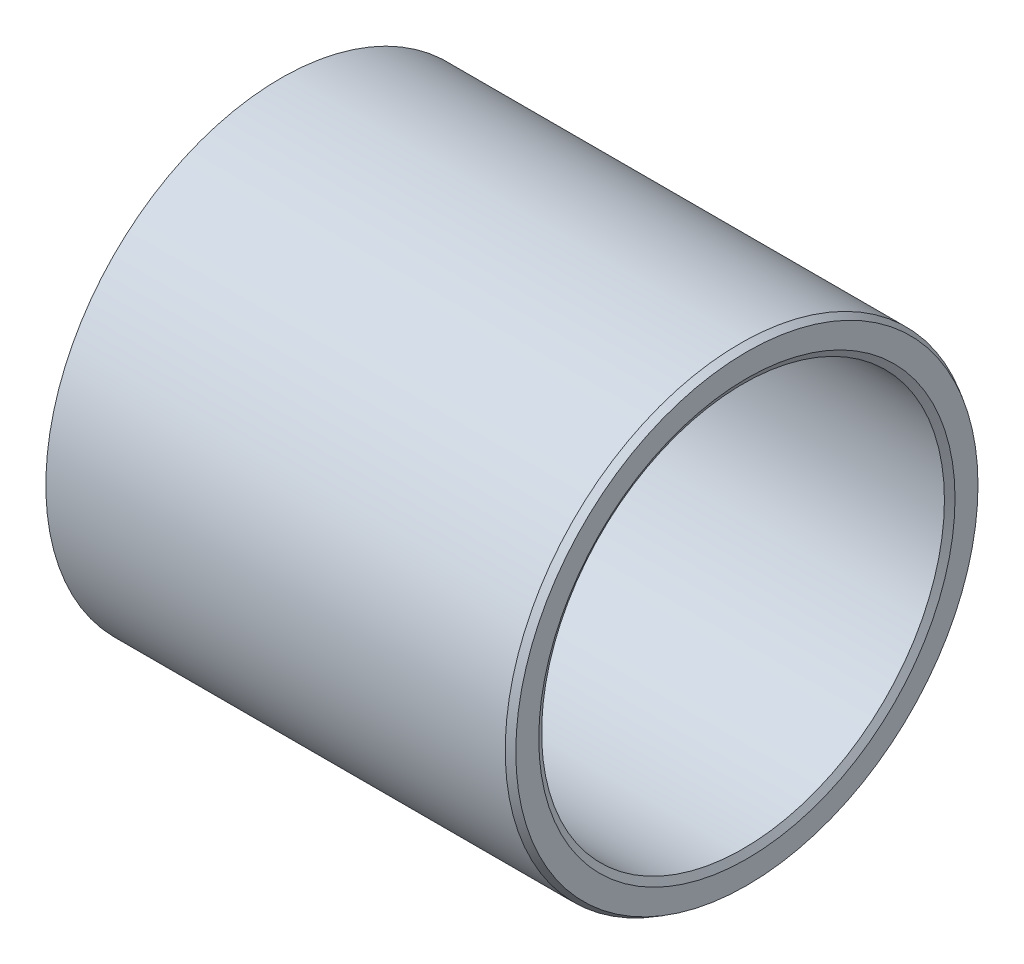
ISO-10303-21;
HEADER;
FILE_DESCRIPTION(('STEP AP214'),'2;1');
FILE_NAME('part.step','',(''),(''),'','','');
FILE_SCHEMA(('AUTOMOTIVE_DESIGN { 1 0 10303 214 1 1 1 1 }'));
ENDSEC;
DATA;
#1=APPLICATION_CONTEXT('core data for automotive mechanical design processes');
#2=APPLICATION_PROTOCOL_DEFINITION('international standard','automotive_design',2000,#1);
#3=PRODUCT_CONTEXT('',#1,'mechanical');
#4=PRODUCT('Part','Part','',(#3));
#5=PRODUCT_RELATED_PRODUCT_CATEGORY('part','',(#4));
#6=PRODUCT_DEFINITION_FORMATION('','',#4);
#7=PRODUCT_DEFINITION_CONTEXT('part definition',#1,'design');
#8=PRODUCT_DEFINITION('design','',#6,#7);
#9=PRODUCT_DEFINITION_SHAPE('','',#8);
#10=(LENGTH_UNIT() NAMED_UNIT(*) SI_UNIT(.MILLI.,.METRE.));
#11=(NAMED_UNIT(*) PLANE_ANGLE_UNIT() SI_UNIT($,.RADIAN.));
#12=(NAMED_UNIT(*) SI_UNIT($,.STERADIAN.) SOLID_ANGLE_UNIT());
#13=UNCERTAINTY_MEASURE_WITH_UNIT(LENGTH_MEASURE(1.E-05),#10,'distance_accuracy_value','');
#14=(GEOMETRIC_REPRESENTATION_CONTEXT(3) GLOBAL_UNCERTAINTY_ASSIGNED_CONTEXT((#13)) GLOBAL_UNIT_ASSIGNED_CONTEXT((#10,
#11,#12)) REPRESENTATION_CONTEXT('',''));
#15=CARTESIAN_POINT('',(0.,0.,0.));
#16=DIRECTION('',(0.,0.,1.));
#17=DIRECTION('',(1.,0.,0.));
#18=AXIS2_PLACEMENT_3D('',#15,#16,#17);
#19=CARTESIAN_POINT('',(3.5,0.,0.));
#20=DIRECTION('',(1.,0.,0.));
#21=DIRECTION('',(0.,0.,-1.));
#22=AXIS2_PLACEMENT_3D('',#19,#20,#21);
#23=PLANE('',#22);
#24=CARTESIAN_POINT('',(3.5,0.,0.));
#25=DIRECTION('',(1.,0.,0.));
#26=DIRECTION('',(0.,0.,-1.));
#27=AXIS2_PLACEMENT_3D('',#24,#25,#26);
#28=CIRCLE('',#27,3.1);
#29=CARTESIAN_POINT('',(3.5,0.,-3.1));
#30=VERTEX_POINT('',#29);
#31=EDGE_CURVE('E10',#30,#30,#28,.F.);
#32=ORIENTED_EDGE('',*,*,#31,.T.);
#33=EDGE_LOOP('',(#32));
#34=FACE_BOUND('',#33,.T.);
#35=CARTESIAN_POINT('',(3.5,0.,0.));
#36=DIRECTION('',(1.,0.,0.));
#37=DIRECTION('',(0.,0.,-1.));
#38=AXIS2_PLACEMENT_3D('',#35,#36,#37);
#39=CIRCLE('',#38,3.44226497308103);
#40=CARTESIAN_POINT('',(3.5,0.,-3.44226497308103));
#41=VERTEX_POINT('',#40);
#42=EDGE_CURVE('E38',#41,#41,#39,.T.);
#43=ORIENTED_EDGE('',*,*,#42,.T.);
#44=EDGE_LOOP('',(#43));
#45=FACE_BOUND('',#44,.T.);
#46=ADVANCED_FACE('F31',(#34,#45),#23,.T.);
#47=CARTESIAN_POINT('',(-3.5,0.,0.));
#48=DIRECTION('',(1.,0.,0.));
#49=DIRECTION('',(0.,0.,-1.));
#50=AXIS2_PLACEMENT_3D('',#47,#48,#49);
#51=PLANE('',#50);
#52=CARTESIAN_POINT('',(-3.5,0.,0.));
#53=DIRECTION('',(1.,0.,0.));
#54=DIRECTION('',(0.,0.,-1.));
#55=AXIS2_PLACEMENT_3D('',#52,#53,#54);
#56=CIRCLE('',#55,3.05773502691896);
#57=CARTESIAN_POINT('',(-3.5,0.,-3.05773502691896));
#58=VERTEX_POINT('',#57);
#59=EDGE_CURVE('E57',#58,#58,#56,.T.);
#60=ORIENTED_EDGE('',*,*,#59,.T.);
#61=EDGE_LOOP('',(#60));
#62=FACE_BOUND('',#61,.T.);
#63=CARTESIAN_POINT('',(-3.5,0.,0.));
#64=DIRECTION('',(1.,0.,0.));
#65=DIRECTION('',(0.,0.,-1.));
#66=AXIS2_PLACEMENT_3D('',#63,#64,#65);
#67=CIRCLE('',#66,3.4);
#68=CARTESIAN_POINT('',(-3.5,0.,-3.4));
#69=VERTEX_POINT('',#68);
#70=EDGE_CURVE('E60',#69,#69,#67,.F.);
#71=ORIENTED_EDGE('',*,*,#70,.T.);
#72=EDGE_LOOP('',(#71));
#73=FACE_BOUND('',#72,.T.);
#74=ADVANCED_FACE('F64',(#62,#73),#51,.F.);
#75=CARTESIAN_POINT('',(3.5,0.,0.));
#76=DIRECTION('',(-1.,0.,0.));
#77=DIRECTION('',(0.,0.,1.));
#78=AXIS2_PLACEMENT_3D('',#75,#76,#77);
#79=CYLINDRICAL_SURFACE('',#78,3.5);
#80=CARTESIAN_POINT('',(-3.44226497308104,0.,0.));
#81=DIRECTION('',(1.,0.,0.));
#82=DIRECTION('',(0.,0.,-1.));
#83=AXIS2_PLACEMENT_3D('',#80,#81,#82);
#84=CIRCLE('',#83,3.5);
#85=CARTESIAN_POINT('',(-3.44226497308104,0.,-3.5));
#86=VERTEX_POINT('',#85);
#87=EDGE_CURVE('E42',#86,#86,#84,.T.);
#88=ORIENTED_EDGE('',*,*,#87,.T.);
#89=EDGE_LOOP('',(#88));
#90=FACE_BOUND('',#89,.T.);
#91=CARTESIAN_POINT('',(3.4,0.,0.));
#92=DIRECTION('',(1.,0.,0.));
#93=DIRECTION('',(0.,0.,-1.));
#94=AXIS2_PLACEMENT_3D('',#91,#92,#93);
#95=CIRCLE('',#94,3.5);
#96=CARTESIAN_POINT('',(3.4,0.,-3.5));
#97=VERTEX_POINT('',#96);
#98=EDGE_CURVE('E46',#97,#97,#95,.F.);
#99=ORIENTED_EDGE('',*,*,#98,.T.);
#100=EDGE_LOOP('',(#99));
#101=FACE_BOUND('',#100,.T.);
#102=ADVANCED_FACE('F74',(#90,#101),#79,.T.);
#103=CARTESIAN_POINT('',(3.5,0.,0.));
#104=DIRECTION('',(-1.,0.,0.));
#105=DIRECTION('',(0.,0.,1.));
#106=AXIS2_PLACEMENT_3D('',#103,#104,#105);
#107=CYLINDRICAL_SURFACE('',#106,3.);
#108=CARTESIAN_POINT('',(-3.4,0.,0.));
#109=DIRECTION('',(1.,0.,0.));
#110=DIRECTION('',(0.,0.,-1.));
#111=AXIS2_PLACEMENT_3D('',#108,#109,#110);
#112=CIRCLE('',#111,3.);
#113=CARTESIAN_POINT('',(-3.4,0.,-3.));
#114=VERTEX_POINT('',#113);
#115=EDGE_CURVE('E51',#114,#114,#112,.F.);
#116=ORIENTED_EDGE('',*,*,#115,.T.);
#117=EDGE_LOOP('',(#116));
#118=FACE_BOUND('',#117,.T.);
#119=CARTESIAN_POINT('',(3.44226497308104,0.,0.));
#120=DIRECTION('',(1.,0.,0.));
#121=DIRECTION('',(0.,0.,-1.));
#122=AXIS2_PLACEMENT_3D('',#119,#120,#121);
#123=CIRCLE('',#122,3.);
#124=CARTESIAN_POINT('',(3.44226497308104,0.,-3.));
#125=VERTEX_POINT('',#124);
#126=EDGE_CURVE('E54',#125,#125,#123,.T.);
#127=ORIENTED_EDGE('',*,*,#126,.T.);
#128=EDGE_LOOP('',(#127));
#129=FACE_BOUND('',#128,.T.);
#130=ADVANCED_FACE('F77',(#118,#129),#107,.F.);
#131=CARTESIAN_POINT('',(-3.5,0.,0.));
#132=DIRECTION('',(-1.,0.,0.));
#133=DIRECTION('',(0.,0.,1.));
#134=AXIS2_PLACEMENT_3D('',#131,#132,#133);
#135=CONICAL_SURFACE('',#134,3.05773502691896,0.523598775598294);
#136=ORIENTED_EDGE('',*,*,#115,.F.);
#137=EDGE_LOOP('',(#136));
#138=FACE_BOUND('',#137,.T.);
#139=ORIENTED_EDGE('',*,*,#59,.F.);
#140=EDGE_LOOP('',(#139));
#141=FACE_BOUND('',#140,.T.);
#142=ADVANCED_FACE('F70',(#138,#141),#135,.F.);
#143=CARTESIAN_POINT('',(-3.44226497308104,0.,0.));
#144=DIRECTION('',(1.,0.,0.));
#145=DIRECTION('',(0.,0.,-1.));
#146=AXIS2_PLACEMENT_3D('',#143,#144,#145);
#147=CONICAL_SURFACE('',#146,3.5,1.0471975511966);
#148=CARTESIAN_POINT('',(-3.5,0.,-3.4));
#149=CARTESIAN_POINT('',(-3.49939859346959,0.,-3.40104166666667));
#150=CARTESIAN_POINT('',(-3.49879718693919,0.,-3.40208333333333));
#151=CARTESIAN_POINT('',(-3.49759437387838,0.,-3.40416666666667));
#152=CARTESIAN_POINT('',(-3.49699296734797,0.,-3.40520833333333));
#153=CARTESIAN_POINT('',(-3.49579015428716,0.,-3.40729166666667));
#154=CARTESIAN_POINT('',(-3.49518874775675,0.,-3.40833333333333));
#155=CARTESIAN_POINT('',(-3.49398593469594,0.,-3.41041666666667));
#156=CARTESIAN_POINT('',(-3.49338452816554,0.,-3.41145833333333));
#157=CARTESIAN_POINT('',(-3.49218171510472,0.,-3.41354166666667));
#158=CARTESIAN_POINT('',(-3.49158030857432,0.,-3.41458333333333));
#159=CARTESIAN_POINT('',(-3.49037749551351,0.,-3.41666666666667));
#160=CARTESIAN_POINT('',(-3.4897760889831,0.,-3.41770833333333));
#161=CARTESIAN_POINT('',(-3.48857327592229,0.,-3.41979166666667));
#162=CARTESIAN_POINT('',(-3.48797186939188,0.,-3.42083333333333));
#163=CARTESIAN_POINT('',(-3.48676905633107,0.,-3.42291666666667));
#164=CARTESIAN_POINT('',(-3.48616764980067,0.,-3.42395833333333));
#165=CARTESIAN_POINT('',(-3.48496483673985,0.,-3.42604166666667));
#166=CARTESIAN_POINT('',(-3.48436343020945,0.,-3.42708333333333));
#167=CARTESIAN_POINT('',(-3.48316061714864,0.,-3.42916666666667));
#168=CARTESIAN_POINT('',(-3.48255921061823,0.,-3.43020833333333));
#169=CARTESIAN_POINT('',(-3.48135639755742,0.,-3.43229166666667));
#170=CARTESIAN_POINT('',(-3.48075499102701,0.,-3.43333333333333));
#171=CARTESIAN_POINT('',(-3.4795521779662,0.,-3.43541666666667));
#172=CARTESIAN_POINT('',(-3.4789507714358,0.,-3.43645833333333));
#173=CARTESIAN_POINT('',(-3.47774795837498,0.,-3.43854166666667));
#174=CARTESIAN_POINT('',(-3.47714655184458,0.,-3.43958333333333));
#175=CARTESIAN_POINT('',(-3.47594373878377,0.,-3.44166666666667));
#176=CARTESIAN_POINT('',(-3.47534233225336,0.,-3.44270833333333));
#177=CARTESIAN_POINT('',(-3.47413951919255,0.,-3.44479166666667));
#178=CARTESIAN_POINT('',(-3.47353811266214,0.,-3.44583333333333));
#179=CARTESIAN_POINT('',(-3.47233529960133,0.,-3.44791666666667));
#180=CARTESIAN_POINT('',(-3.47173389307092,0.,-3.44895833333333));
#181=CARTESIAN_POINT('',(-3.47053108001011,0.,-3.45104166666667));
#182=CARTESIAN_POINT('',(-3.46992967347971,0.,-3.45208333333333));
#183=CARTESIAN_POINT('',(-3.4687268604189,0.,-3.45416666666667));
#184=CARTESIAN_POINT('',(-3.46812545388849,0.,-3.45520833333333));
#185=CARTESIAN_POINT('',(-3.46692264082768,0.,-3.45729166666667));
#186=CARTESIAN_POINT('',(-3.46632123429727,0.,-3.45833333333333));
#187=CARTESIAN_POINT('',(-3.46511842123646,0.,-3.46041666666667));
#188=CARTESIAN_POINT('',(-3.46451701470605,0.,-3.46145833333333));
#189=CARTESIAN_POINT('',(-3.46331420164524,0.,-3.46354166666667));
#190=CARTESIAN_POINT('',(-3.46271279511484,0.,-3.46458333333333));
#191=CARTESIAN_POINT('',(-3.46150998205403,0.,-3.46666666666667));
#192=CARTESIAN_POINT('',(-3.46090857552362,0.,-3.46770833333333));
#193=CARTESIAN_POINT('',(-3.45970576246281,0.,-3.46979166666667));
#194=CARTESIAN_POINT('',(-3.4591043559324,0.,-3.47083333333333));
#195=CARTESIAN_POINT('',(-3.45790154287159,0.,-3.47291666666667));
#196=CARTESIAN_POINT('',(-3.45730013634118,0.,-3.47395833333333));
#197=CARTESIAN_POINT('',(-3.45609732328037,0.,-3.47604166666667));
#198=CARTESIAN_POINT('',(-3.45549591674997,0.,-3.47708333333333));
#199=CARTESIAN_POINT('',(-3.45429310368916,0.,-3.47916666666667));
#200=CARTESIAN_POINT('',(-3.45369169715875,0.,-3.48020833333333));
#201=CARTESIAN_POINT('',(-3.45248888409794,0.,-3.48229166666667));
#202=CARTESIAN_POINT('',(-3.45188747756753,0.,-3.48333333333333));
#203=CARTESIAN_POINT('',(-3.45068466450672,0.,-3.48541666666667));
#204=CARTESIAN_POINT('',(-3.45008325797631,0.,-3.48645833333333));
#205=CARTESIAN_POINT('',(-3.4488804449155,0.,-3.48854166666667));
#206=CARTESIAN_POINT('',(-3.4482790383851,0.,-3.48958333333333));
#207=CARTESIAN_POINT('',(-3.44707622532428,0.,-3.49166666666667));
#208=CARTESIAN_POINT('',(-3.44647481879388,0.,-3.49270833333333));
#209=CARTESIAN_POINT('',(-3.44527200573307,0.,-3.49479166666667));
#210=CARTESIAN_POINT('',(-3.44467059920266,0.,-3.49583333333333));
#211=CARTESIAN_POINT('',(-3.44346778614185,0.,-3.49791666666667));
#212=CARTESIAN_POINT('',(-3.44286637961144,0.,-3.49895833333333));
#213=CARTESIAN_POINT('',(-3.44226497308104,0.,-3.5));
#214=B_SPLINE_CURVE_WITH_KNOTS('',3,(#148,#149,#150,#151,#152,#153,#154,#155,#156,#157,#158,
#159,#160,#161,#162,#163,#164,#165,#166,#167,#168,#169,#170,#171,#172,#173,#174,#175,#176,#177,
#178,#179,#180,#181,#182,#183,#184,#185,#186,#187,#188,#189,#190,#191,#192,#193,#194,#195,#196,
#197,#198,#199,#200,#201,#202,#203,#204,#205,#206,#207,#208,#209,#210,#211,#212,#213),
.UNSPECIFIED.,.F.,.F.,(4,2,2,2,2,2,2,2,2,2,2,2,2,2,2,2,2,2,2,2,2,2,2,2,2,2,2,2,2,2,2,2,4),(0.,
0.00360843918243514,0.00721687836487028,0.0108253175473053,0.0144337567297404,
0.0180421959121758,0.0216506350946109,0.0252590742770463,0.028867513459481,0.0324759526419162,
0.0360843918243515,0.0396928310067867,0.0433012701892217,0.0469097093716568,0.0505181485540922,
0.0541265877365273,0.0577350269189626,0.0613434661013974,0.0649519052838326,0.0685603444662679,
0.072168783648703,0.0757772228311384,0.0793856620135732,0.0829941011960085,0.0866025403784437,
0.0902109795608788,0.0938194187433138,0.0974278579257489,0.101036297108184,0.104644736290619,
0.108253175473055,0.11186161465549,0.115470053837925),.UNSPECIFIED.);
#215=EDGE_CURVE('BSEAM66',#69,#86,#214,.T.);
#216=ORIENTED_EDGE('',*,*,#70,.F.);
#217=ORIENTED_EDGE('',*,*,#87,.F.);
#218=ORIENTED_EDGE('',*,*,#215,.T.);
#219=ORIENTED_EDGE('',*,*,#215,.F.);
#220=EDGE_LOOP('',(#216,#218,#217,#219));
#221=FACE_BOUND('',#220,.T.);
#222=ADVANCED_FACE('F66',(#221),#147,.T.);
#223=CARTESIAN_POINT('',(3.44226497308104,0.,0.));
#224=DIRECTION('',(1.,0.,0.));
#225=DIRECTION('',(0.,0.,-1.));
#226=AXIS2_PLACEMENT_3D('',#223,#224,#225);
#227=CONICAL_SURFACE('',#226,3.,1.0471975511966);
#228=ORIENTED_EDGE('',*,*,#31,.F.);
#229=EDGE_LOOP('',(#228));
#230=FACE_BOUND('',#229,.T.);
#231=ORIENTED_EDGE('',*,*,#126,.F.);
#232=EDGE_LOOP('',(#231));
#233=FACE_BOUND('',#232,.T.);
#234=ADVANCED_FACE('F69',(#230,#233),#227,.F.);
#235=CARTESIAN_POINT('',(3.5,0.,0.));
#236=DIRECTION('',(-1.,0.,0.));
#237=DIRECTION('',(0.,0.,1.));
#238=AXIS2_PLACEMENT_3D('',#235,#236,#237);
#239=CONICAL_SURFACE('',#238,3.44226497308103,0.523598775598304);
#240=ORIENTED_EDGE('',*,*,#98,.F.);
#241=EDGE_LOOP('',(#240));
#242=FACE_BOUND('',#241,.T.);
#243=ORIENTED_EDGE('',*,*,#42,.F.);
#244=EDGE_LOOP('',(#243));
#245=FACE_BOUND('',#244,.T.);
#246=ADVANCED_FACE('F33',(#242,#245),#239,.T.);
#247=CLOSED_SHELL('',(#46,#74,#102,#130,#142,#222,#234,#246));
#248=MANIFOLD_SOLID_BREP('B2',#247);
#249=ADVANCED_BREP_SHAPE_REPRESENTATION('',(#18,#248),#14);
#250=SHAPE_DEFINITION_REPRESENTATION(#9,#249);
ENDSEC;
END-ISO-10303-21;
